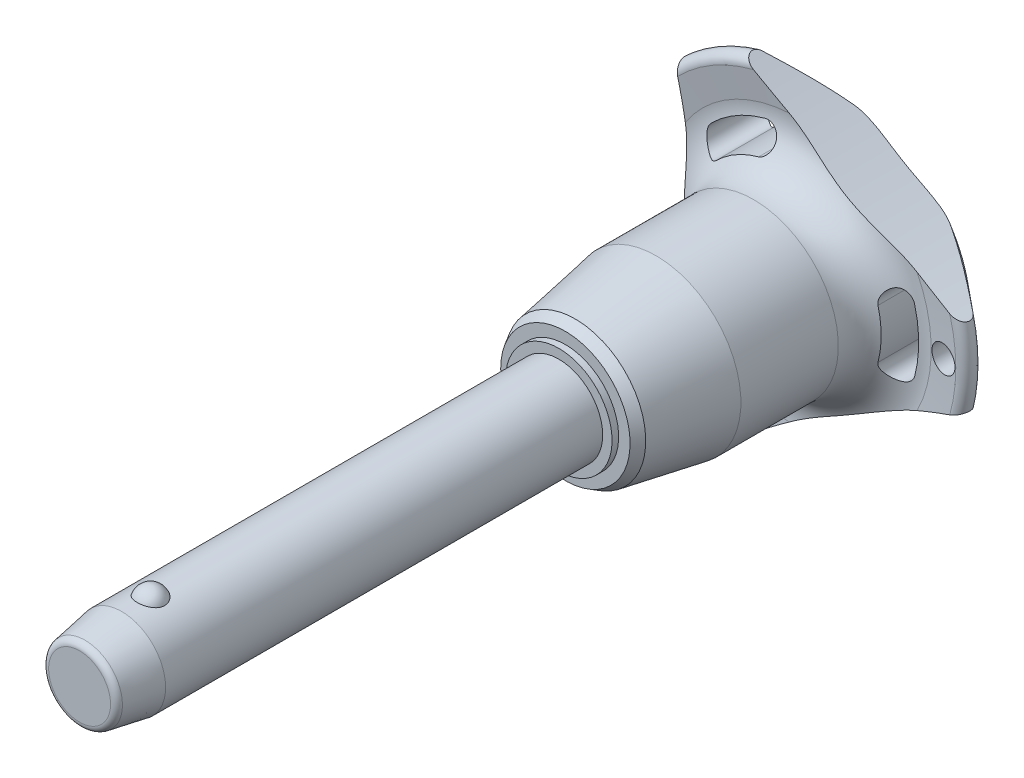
from build123d import *

# Parameters (mm, degrees)
SKETCH1_R           = 5
BOSS_EXTRUDE1_DEPTH = 45
SKETCH2_R           = 4.25
BOSS_EXTRUDE2_DEPTH = 33.3
BOSS_EXTRUDE3_START = 9.6
SKETCH1_2_R         = 5
BOSS_EXTRUDE3_DEPTH = 9.6
CHAMFER1_SIZE       = 4.8
CHAMFER1_SIZE2      = 0.846369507
FILLET1_R           = 0.75
SKETCH6_R           = 102.8
CUT_EXTRUDE1_DEPTH  = 84.064879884
CIRPATTERN1_COUNT   = 3
SKETCH7_R           = 1.5
CUT_EXTRUDE2_DEPTH  = 83.869938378


with BuildPart() as part:
    # Sketch1 → Boss-Extrude1 (new body)
    with BuildSketch(Plane.XY):
        Circle(SKETCH1_R)
    extrude(amount=-BOSS_EXTRUDE1_DEPTH)

    # Sketch2 → Boss-Extrude2 (add)
    with BuildSketch(Plane(origin=(0, 0, -45), x_dir=(-1, 0, 0), z_dir=(0, 0, -1))):
        Circle(SKETCH2_R)
    extrude(amount=BOSS_EXTRUDE2_DEPTH)

    # Sketch3 → Revolve1 (revolve)
    with BuildSketch(Plane(origin=(0, 0, 0), x_dir=(0, 0, -1), z_dir=(1, 0, 0))):
        with BuildLine():
            Line((-1.516575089, 6), (-1.516575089, 2.7))
            ThreePointArc((-1.516575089, 2.7), (0.133424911, 4.35), (-1.516575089, 6))
        make_face()
        with BuildLine():
            Line((-1.516575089, -2.7), (-1.516575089, -6))
            ThreePointArc((-1.516575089, -6), (0.133424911, -4.35), (-1.516575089, -2.7))
        make_face()
    revolve(axis=Axis((0, -2.7, 1.516575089), (0, 1, 0)))

    # Sketch1_2 → Boss-Extrude3 (add)
    with BuildSketch(Plane.XY.offset(BOSS_EXTRUDE3_START)):
        Circle(SKETCH1_2_R)
    extrude(amount=-BOSS_EXTRUDE3_DEPTH)

    # Chamfer1
    chamfer1_edges = [part.edges().sort_by_distance(p)[0] for p in [
        (-5, 0, 9.6),
    ]]
    chamfer1_side = [part.faces().sort_by_distance(p)[0] for p in [
        (-5, 0, -17.7),
    ]]
    chamfer(chamfer1_edges, length=CHAMFER1_SIZE, length2=CHAMFER1_SIZE2, reference=chamfer1_side[0])

    # Fillet1
    fillet1_edges = [part.edges().sort_by_distance(p)[0] for p in [
        (-4.153630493, 0, 9.6),
        (4.25, 0, -78.3),
    ]]
    fillet(fillet1_edges, radius=FILLET1_R)

    # Sketch4 → Revolve2 (revolve)
    with BuildSketch(Plane(origin=(0, 0, 0), x_dir=(0, 0, -1), z_dir=(1, 0, 0)), mode=Mode.PRIVATE) as revolve2_sk:
        Polygon((45, 0), (45, 6.067402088), (45.75, 6.067402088), (45.75, 7.371950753), (46.879772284, 8.024225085), (56.1, 9.65), (67.2, 9.65), (67.2, 0), align=None)
    revolve(revolve2_sk.sketch.rotate(Axis((0, 0, -67.2), (0, 0, 1)), 90), axis=Axis((0, 0, -67.2), (0, 0, 1)))

    # Sketch5 → Revolve3 (revolve)
    with BuildSketch(Plane(origin=(0, 0, 0), x_dir=(0, 0, -1), z_dir=(1, 0, 0)), mode=Mode.PRIVATE) as revolve3_sk:
        with BuildLine():
            Line((72.16082631, 15.274661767), (71.757834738, 18.475067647))
            ThreePointArc((71.757834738, 18.475067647), (72.349836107, 19.516443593), (73.516044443, 19.24278761))
            Line((73.516044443, 19.24278761), (77.835691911, 14.094832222))
            ThreePointArc((77.835691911, 14.094832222), (78.3, 12.689260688), (77.67067517, 11.349423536))
            ThreePointArc((77.67067517, 11.349423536), (74.033110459, 6.185112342), (72.75, 0))
            Line((72.75, 0), (67.2, 0))
            Line((67.2, 0), (67.2, 9.65))
            ThreePointArc((67.2, 9.65), (70.949887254, 11.342683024), (72.16082631, 15.274661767))
        make_face()
    revolve(revolve3_sk.sketch.rotate(Axis((0, 0, -72.75), (0, 0, 1)), 90), axis=Axis((0, 0, -72.75), (0, 0, 1)))

    # Sketch6 → Cut-Extrude1 (cut, through all)
    with BuildSketch(Plane.XY):
        with Locations((-115.2, 0)):
            Circle(SKETCH6_R)
        with BuildLine():
            ThreePointArc((13.411913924, -3.529271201), (13.868496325, 0), (13.411913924, 3.529271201))
            ThreePointArc((13.411913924, 3.529271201), (11.694200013, 4.531299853), (10.692171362, 2.813585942))
            ThreePointArc((10.692171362, 2.813585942), (11.056165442, 0), (10.692171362, -2.813585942))
            ThreePointArc((10.692171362, -2.813585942), (11.694200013, -4.531299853), (13.411913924, -3.529271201))
        make_face()
    cut_extrude1 = extrude(amount=-CUT_EXTRUDE1_DEPTH, mode=Mode.SUBTRACT)

    # CirPattern1: Cut-Extrude1 ×3 about axis
    cirpattern1_axis = Axis((0, 0, 0), (0, 0, 1))
    for i in range(1, CIRPATTERN1_COUNT):
        add(cut_extrude1.rotate(cirpattern1_axis, i * 360 / CIRPATTERN1_COUNT), mode=Mode.SUBTRACT)

    # Sketch7 → Cut-Extrude2 (cut, through all)
    with BuildSketch(Plane.XY):
        with Locations(Location((16.868496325, 0, 0), (0, 0, 225.467095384))):
            Circle(SKETCH7_R)
    extrude(amount=-CUT_EXTRUDE2_DEPTH, mode=Mode.SUBTRACT)


solid = part.part
